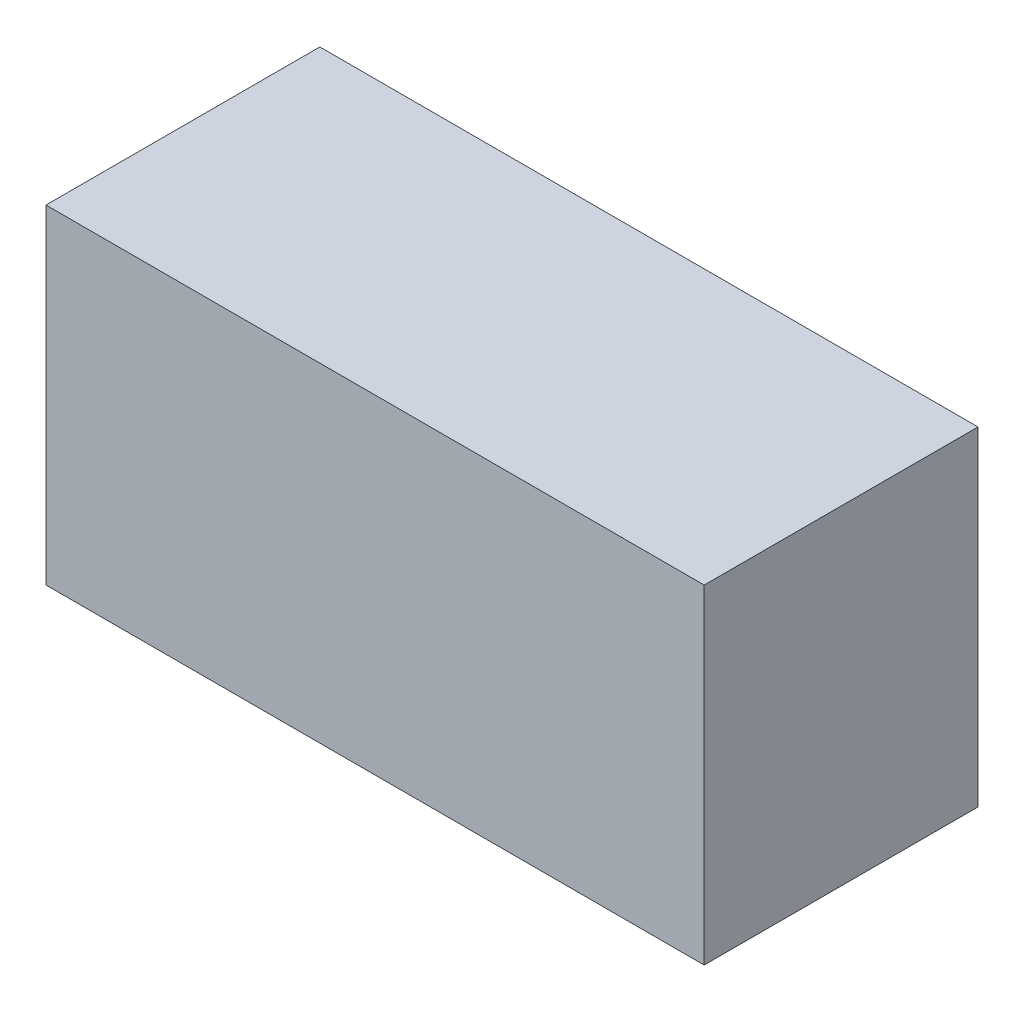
ISO-10303-21;
HEADER;
FILE_DESCRIPTION(('STEP AP214'),'2;1');
FILE_NAME('part.step','',(''),(''),'','','');
FILE_SCHEMA(('AUTOMOTIVE_DESIGN { 1 0 10303 214 1 1 1 1 }'));
ENDSEC;
DATA;
#1=APPLICATION_CONTEXT('core data for automotive mechanical design processes');
#2=APPLICATION_PROTOCOL_DEFINITION('international standard','automotive_design',2000,#1);
#3=PRODUCT_CONTEXT('',#1,'mechanical');
#4=PRODUCT('Part','Part','',(#3));
#5=PRODUCT_RELATED_PRODUCT_CATEGORY('part','',(#4));
#6=PRODUCT_DEFINITION_FORMATION('','',#4);
#7=PRODUCT_DEFINITION_CONTEXT('part definition',#1,'design');
#8=PRODUCT_DEFINITION('design','',#6,#7);
#9=PRODUCT_DEFINITION_SHAPE('','',#8);
#10=(LENGTH_UNIT() NAMED_UNIT(*) SI_UNIT(.MILLI.,.METRE.));
#11=(NAMED_UNIT(*) PLANE_ANGLE_UNIT() SI_UNIT($,.RADIAN.));
#12=(NAMED_UNIT(*) SI_UNIT($,.STERADIAN.) SOLID_ANGLE_UNIT());
#13=UNCERTAINTY_MEASURE_WITH_UNIT(LENGTH_MEASURE(1.E-05),#10,'distance_accuracy_value','');
#14=(GEOMETRIC_REPRESENTATION_CONTEXT(3) GLOBAL_UNCERTAINTY_ASSIGNED_CONTEXT((#13)) GLOBAL_UNIT_ASSIGNED_CONTEXT((#10,
#11,#12)) REPRESENTATION_CONTEXT('',''));
#15=CARTESIAN_POINT('',(0.,0.,0.));
#16=DIRECTION('',(0.,0.,1.));
#17=DIRECTION('',(1.,0.,0.));
#18=AXIS2_PLACEMENT_3D('',#15,#16,#17);
#19=CARTESIAN_POINT('',(127.,63.5,105.664));
#20=DIRECTION('',(-1.,0.,0.));
#21=DIRECTION('',(0.,0.,1.));
#22=AXIS2_PLACEMENT_3D('',#19,#20,#21);
#23=PLANE('',#22);
#24=DIRECTION('',(0.,1.,0.));
#25=VECTOR('',#24,1.);
#26=CARTESIAN_POINT('',(127.,63.5,0.));
#27=LINE('',#26,#25);
#28=CARTESIAN_POINT('',(127.,-63.5,0.));
#29=VERTEX_POINT('',#28);
#30=CARTESIAN_POINT('',(127.,63.5,0.));
#31=VERTEX_POINT('',#30);
#32=EDGE_CURVE('E96',#29,#31,#27,.T.);
#33=ORIENTED_EDGE('',*,*,#32,.T.);
#34=DIRECTION('',(0.,0.,-1.));
#35=VECTOR('',#34,1.);
#36=CARTESIAN_POINT('',(127.,63.5,105.664));
#37=LINE('',#36,#35);
#38=CARTESIAN_POINT('',(127.,63.5,105.664));
#39=VERTEX_POINT('',#38);
#40=EDGE_CURVE('E11',#39,#31,#37,.T.);
#41=ORIENTED_EDGE('',*,*,#40,.F.);
#42=DIRECTION('',(0.,1.,0.));
#43=VECTOR('',#42,1.);
#44=CARTESIAN_POINT('',(127.,63.5,105.664));
#45=LINE('',#44,#43);
#46=CARTESIAN_POINT('',(127.,-63.5,105.664));
#47=VERTEX_POINT('',#46);
#48=EDGE_CURVE('E84',#47,#39,#45,.T.);
#49=ORIENTED_EDGE('',*,*,#48,.F.);
#50=DIRECTION('',(0.,0.,-1.));
#51=VECTOR('',#50,1.);
#52=CARTESIAN_POINT('',(127.,-63.5,105.664));
#53=LINE('',#52,#51);
#54=EDGE_CURVE('E92',#47,#29,#53,.T.);
#55=ORIENTED_EDGE('',*,*,#54,.T.);
#56=EDGE_LOOP('',(#33,#41,#49,#55));
#57=FACE_BOUND('',#56,.T.);
#58=ADVANCED_FACE('F33',(#57),#23,.F.);
#59=CARTESIAN_POINT('',(-127.,63.5,105.664));
#60=DIRECTION('',(0.,-1.,0.));
#61=DIRECTION('',(0.,0.,-1.));
#62=AXIS2_PLACEMENT_3D('',#59,#60,#61);
#63=PLANE('',#62);
#64=DIRECTION('',(-1.,0.,0.));
#65=VECTOR('',#64,1.);
#66=CARTESIAN_POINT('',(-127.,63.5,0.));
#67=LINE('',#66,#65);
#68=CARTESIAN_POINT('',(-127.,63.5,0.));
#69=VERTEX_POINT('',#68);
#70=EDGE_CURVE('E88',#31,#69,#67,.T.);
#71=ORIENTED_EDGE('',*,*,#70,.T.);
#72=DIRECTION('',(0.,0.,-1.));
#73=VECTOR('',#72,1.);
#74=CARTESIAN_POINT('',(-127.,63.5,105.664));
#75=LINE('',#74,#73);
#76=CARTESIAN_POINT('',(-127.,63.5,105.664));
#77=VERTEX_POINT('',#76);
#78=EDGE_CURVE('E41',#77,#69,#75,.T.);
#79=ORIENTED_EDGE('',*,*,#78,.F.);
#80=DIRECTION('',(-1.,0.,0.));
#81=VECTOR('',#80,1.);
#82=CARTESIAN_POINT('',(-127.,63.5,105.664));
#83=LINE('',#82,#81);
#84=EDGE_CURVE('E79',#39,#77,#83,.T.);
#85=ORIENTED_EDGE('',*,*,#84,.F.);
#86=ORIENTED_EDGE('',*,*,#40,.T.);
#87=EDGE_LOOP('',(#71,#79,#85,#86));
#88=FACE_BOUND('',#87,.T.);
#89=ADVANCED_FACE('F87',(#88),#63,.F.);
#90=CARTESIAN_POINT('',(-127.,63.5,105.664));
#91=DIRECTION('',(1.,0.,0.));
#92=DIRECTION('',(0.,1.,0.));
#93=AXIS2_PLACEMENT_3D('',#90,#91,#92);
#94=PLANE('',#93);
#95=DIRECTION('',(0.,-1.,0.));
#96=VECTOR('',#95,1.);
#97=CARTESIAN_POINT('',(-127.,63.5,0.));
#98=LINE('',#97,#96);
#99=CARTESIAN_POINT('',(-127.,-63.5,0.));
#100=VERTEX_POINT('',#99);
#101=EDGE_CURVE('E66',#69,#100,#98,.T.);
#102=ORIENTED_EDGE('',*,*,#101,.T.);
#103=DIRECTION('',(0.,0.,-1.));
#104=VECTOR('',#103,1.);
#105=CARTESIAN_POINT('',(-127.,-63.5,105.664));
#106=LINE('',#105,#104);
#107=CARTESIAN_POINT('',(-127.,-63.5,105.664));
#108=VERTEX_POINT('',#107);
#109=EDGE_CURVE('E89',#108,#100,#106,.T.);
#110=ORIENTED_EDGE('',*,*,#109,.F.);
#111=DIRECTION('',(0.,-1.,0.));
#112=VECTOR('',#111,1.);
#113=CARTESIAN_POINT('',(-127.,63.5,105.664));
#114=LINE('',#113,#112);
#115=EDGE_CURVE('E82',#77,#108,#114,.T.);
#116=ORIENTED_EDGE('',*,*,#115,.F.);
#117=ORIENTED_EDGE('',*,*,#78,.T.);
#118=EDGE_LOOP('',(#102,#110,#116,#117));
#119=FACE_BOUND('',#118,.T.);
#120=ADVANCED_FACE('F90',(#119),#94,.F.);
#121=CARTESIAN_POINT('',(-127.,-63.5,105.664));
#122=DIRECTION('',(0.,1.,0.));
#123=DIRECTION('',(0.,0.,1.));
#124=AXIS2_PLACEMENT_3D('',#121,#122,#123);
#125=PLANE('',#124);
#126=DIRECTION('',(1.,0.,0.));
#127=VECTOR('',#126,1.);
#128=CARTESIAN_POINT('',(-127.,-63.5,0.));
#129=LINE('',#128,#127);
#130=EDGE_CURVE('E72',#100,#29,#129,.T.);
#131=ORIENTED_EDGE('',*,*,#130,.T.);
#132=ORIENTED_EDGE('',*,*,#54,.F.);
#133=DIRECTION('',(1.,0.,0.));
#134=VECTOR('',#133,1.);
#135=CARTESIAN_POINT('',(-127.,-63.5,105.664));
#136=LINE('',#135,#134);
#137=EDGE_CURVE('E49',#108,#47,#136,.T.);
#138=ORIENTED_EDGE('',*,*,#137,.F.);
#139=ORIENTED_EDGE('',*,*,#109,.T.);
#140=EDGE_LOOP('',(#131,#132,#138,#139));
#141=FACE_BOUND('',#140,.T.);
#142=ADVANCED_FACE('F103',(#141),#125,.F.);
#143=CARTESIAN_POINT('',(127.,-63.5,105.664));
#144=DIRECTION('',(0.,0.,1.));
#145=DIRECTION('',(1.,0.,0.));
#146=AXIS2_PLACEMENT_3D('',#143,#144,#145);
#147=PLANE('',#146);
#148=ORIENTED_EDGE('',*,*,#48,.T.);
#149=ORIENTED_EDGE('',*,*,#84,.T.);
#150=ORIENTED_EDGE('',*,*,#115,.T.);
#151=ORIENTED_EDGE('',*,*,#137,.T.);
#152=EDGE_LOOP('',(#148,#149,#150,#151));
#153=FACE_BOUND('',#152,.T.);
#154=ADVANCED_FACE('F80',(#153),#147,.T.);
#155=CARTESIAN_POINT('',(127.,-63.5,0.));
#156=DIRECTION('',(0.,0.,1.));
#157=DIRECTION('',(1.,0.,0.));
#158=AXIS2_PLACEMENT_3D('',#155,#156,#157);
#159=PLANE('',#158);
#160=ORIENTED_EDGE('',*,*,#32,.F.);
#161=ORIENTED_EDGE('',*,*,#130,.F.);
#162=ORIENTED_EDGE('',*,*,#101,.F.);
#163=ORIENTED_EDGE('',*,*,#70,.F.);
#164=EDGE_LOOP('',(#160,#161,#162,#163));
#165=FACE_BOUND('',#164,.T.);
#166=ADVANCED_FACE('F106',(#165),#159,.F.);
#167=CLOSED_SHELL('',(#58,#89,#120,#142,#154,#166));
#168=MANIFOLD_SOLID_BREP('B2',#167);
#169=ADVANCED_BREP_SHAPE_REPRESENTATION('',(#18,#168),#14);
#170=SHAPE_DEFINITION_REPRESENTATION(#9,#169);
ENDSEC;
END-ISO-10303-21;
